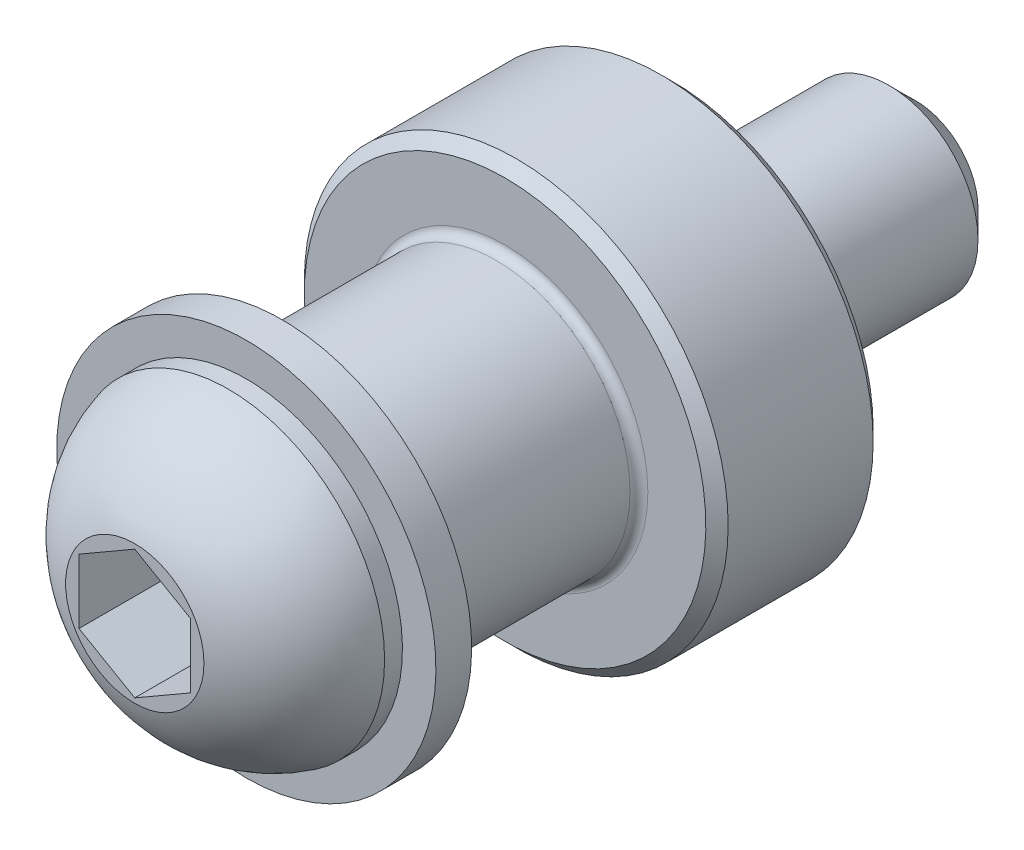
ISO-10303-21;
HEADER;
FILE_DESCRIPTION(('STEP AP214'),'2;1');
FILE_NAME('part.step','',(''),(''),'','','');
FILE_SCHEMA(('AUTOMOTIVE_DESIGN { 1 0 10303 214 1 1 1 1 }'));
ENDSEC;
DATA;
#1=APPLICATION_CONTEXT('core data for automotive mechanical design processes');
#2=APPLICATION_PROTOCOL_DEFINITION('international standard','automotive_design',2000,#1);
#3=PRODUCT_CONTEXT('',#1,'mechanical');
#4=PRODUCT('Part','Part','',(#3));
#5=PRODUCT_RELATED_PRODUCT_CATEGORY('part','',(#4));
#6=PRODUCT_DEFINITION_FORMATION('','',#4);
#7=PRODUCT_DEFINITION_CONTEXT('part definition',#1,'design');
#8=PRODUCT_DEFINITION('design','',#6,#7);
#9=PRODUCT_DEFINITION_SHAPE('','',#8);
#10=(LENGTH_UNIT() NAMED_UNIT(*) SI_UNIT(.MILLI.,.METRE.));
#11=(NAMED_UNIT(*) PLANE_ANGLE_UNIT() SI_UNIT($,.RADIAN.));
#12=(NAMED_UNIT(*) SI_UNIT($,.STERADIAN.) SOLID_ANGLE_UNIT());
#13=UNCERTAINTY_MEASURE_WITH_UNIT(LENGTH_MEASURE(1.E-05),#10,'distance_accuracy_value','');
#14=(GEOMETRIC_REPRESENTATION_CONTEXT(3) GLOBAL_UNCERTAINTY_ASSIGNED_CONTEXT((#13)) GLOBAL_UNIT_ASSIGNED_CONTEXT((#10,
#11,#12)) REPRESENTATION_CONTEXT('',''));
#15=CARTESIAN_POINT('',(0.,0.,0.));
#16=DIRECTION('',(0.,0.,1.));
#17=DIRECTION('',(1.,0.,0.));
#18=AXIS2_PLACEMENT_3D('',#15,#16,#17);
#19=CARTESIAN_POINT('',(2.5,-2.921392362,20.1));
#20=DIRECTION('',(0.,0.,-1.));
#21=DIRECTION('',(-1.,0.,0.));
#22=AXIS2_PLACEMENT_3D('',#19,#20,#21);
#23=PLANE('',#22);
#24=DIRECTION('',(-0.866025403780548,-0.500000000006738,0.));
#25=VECTOR('',#24,1.);
#26=CARTESIAN_POINT('',(-1.25,2.1650635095,20.1));
#27=LINE('',#26,#25);
#28=CARTESIAN_POINT('',(-7.05487453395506E-10,2.88675134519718,20.1));
#29=VERTEX_POINT('',#28);
#30=CARTESIAN_POINT('',(-2.5,1.44337567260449,20.1));
#31=VERTEX_POINT('',#30);
#32=EDGE_CURVE('E79',#29,#31,#27,.T.);
#33=ORIENTED_EDGE('',*,*,#32,.T.);
#34=DIRECTION('',(0.,-1.,0.));
#35=VECTOR('',#34,1.);
#36=CARTESIAN_POINT('',(-2.5,0.,20.1));
#37=LINE('',#36,#35);
#38=CARTESIAN_POINT('',(-2.5,-1.44337567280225,20.1));
#39=VERTEX_POINT('',#38);
#40=EDGE_CURVE('E74',#31,#39,#37,.T.);
#41=ORIENTED_EDGE('',*,*,#40,.T.);
#42=DIRECTION('',(0.866025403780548,-0.500000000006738,0.));
#43=VECTOR('',#42,1.);
#44=CARTESIAN_POINT('',(-1.25,-2.1650635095,20.1));
#45=LINE('',#44,#43);
#46=CARTESIAN_POINT('',(7.05487453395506E-10,-2.88675134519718,20.1));
#47=VERTEX_POINT('',#46);
#48=EDGE_CURVE('E76',#39,#47,#45,.T.);
#49=ORIENTED_EDGE('',*,*,#48,.T.);
#50=DIRECTION('',(0.866025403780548,0.500000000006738,0.));
#51=VECTOR('',#50,1.);
#52=CARTESIAN_POINT('',(1.25,-2.1650635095,20.1));
#53=LINE('',#52,#51);
#54=CARTESIAN_POINT('',(2.5,-1.44337567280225,20.1));
#55=VERTEX_POINT('',#54);
#56=EDGE_CURVE('E92',#47,#55,#53,.T.);
#57=ORIENTED_EDGE('',*,*,#56,.T.);
#58=DIRECTION('',(0.,1.,0.));
#59=VECTOR('',#58,1.);
#60=CARTESIAN_POINT('',(2.5,0.,20.1));
#61=LINE('',#60,#59);
#62=CARTESIAN_POINT('',(2.5,1.44337567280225,20.1));
#63=VERTEX_POINT('',#62);
#64=EDGE_CURVE('E97',#55,#63,#61,.T.);
#65=ORIENTED_EDGE('',*,*,#64,.T.);
#66=DIRECTION('',(-0.866025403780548,0.500000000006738,0.));
#67=VECTOR('',#66,1.);
#68=CARTESIAN_POINT('',(1.25,2.1650635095,20.1));
#69=LINE('',#68,#67);
#70=EDGE_CURVE('E100',#63,#29,#69,.T.);
#71=ORIENTED_EDGE('',*,*,#70,.T.);
#72=EDGE_LOOP('',(#33,#41,#49,#57,#65,#71));
#73=FACE_BOUND('',#72,.T.);
#74=ADVANCED_FACE('F14',(#73),#23,.F.);
#75=CARTESIAN_POINT('',(-2.5,1.443375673,24.1));
#76=DIRECTION('',(-0.500000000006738,0.866025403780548,0.));
#77=DIRECTION('',(0.866025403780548,0.500000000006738,0.));
#78=AXIS2_PLACEMENT_3D('',#75,#76,#77);
#79=PLANE('',#78);
#80=DIRECTION('',(0.,0.,1.));
#81=VECTOR('',#80,1.);
#82=CARTESIAN_POINT('',(-2.5,1.443375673,22.1));
#83=LINE('',#82,#81);
#84=CARTESIAN_POINT('',(-2.49999999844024,1.44337567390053,24.1));
#85=VERTEX_POINT('',#84);
#86=EDGE_CURVE('E54',#31,#85,#83,.T.);
#87=ORIENTED_EDGE('',*,*,#86,.F.);
#88=ORIENTED_EDGE('',*,*,#32,.F.);
#89=DIRECTION('',(0.,0.,-1.));
#90=VECTOR('',#89,1.);
#91=CARTESIAN_POINT('',(0.,2.886751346,22.1));
#92=LINE('',#91,#90);
#93=CARTESIAN_POINT('',(0.,2.886751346,24.1));
#94=VERTEX_POINT('',#93);
#95=EDGE_CURVE('E102',#94,#29,#92,.T.);
#96=ORIENTED_EDGE('',*,*,#95,.F.);
#97=DIRECTION('',(0.866025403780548,0.500000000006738,0.));
#98=VECTOR('',#97,1.);
#99=CARTESIAN_POINT('',(-2.5,1.443375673,24.1));
#100=LINE('',#99,#98);
#101=EDGE_CURVE('E139',#94,#85,#100,.F.);
#102=ORIENTED_EDGE('',*,*,#101,.T.);
#103=EDGE_LOOP('',(#87,#88,#96,#102));
#104=FACE_BOUND('',#103,.T.);
#105=ADVANCED_FACE('F247',(#104),#79,.F.);
#106=CARTESIAN_POINT('',(-2.5,-1.443375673,24.1));
#107=DIRECTION('',(-1.,0.,0.));
#108=DIRECTION('',(0.,1.,0.));
#109=AXIS2_PLACEMENT_3D('',#106,#107,#108);
#110=PLANE('',#109);
#111=DIRECTION('',(0.,0.,-1.));
#112=VECTOR('',#111,1.);
#113=CARTESIAN_POINT('',(-2.5,-1.443375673,22.1));
#114=LINE('',#113,#112);
#115=CARTESIAN_POINT('',(-2.49999999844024,-1.44337567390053,24.1));
#116=VERTEX_POINT('',#115);
#117=EDGE_CURVE('E80',#116,#39,#114,.T.);
#118=ORIENTED_EDGE('',*,*,#117,.T.);
#119=ORIENTED_EDGE('',*,*,#40,.F.);
#120=ORIENTED_EDGE('',*,*,#86,.T.);
#121=DIRECTION('',(0.,-1.,0.));
#122=VECTOR('',#121,1.);
#123=CARTESIAN_POINT('',(-2.49999999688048,0.,24.1));
#124=LINE('',#123,#122);
#125=EDGE_CURVE('E48',#85,#116,#124,.T.);
#126=ORIENTED_EDGE('',*,*,#125,.T.);
#127=EDGE_LOOP('',(#118,#119,#120,#126));
#128=FACE_BOUND('',#127,.T.);
#129=ADVANCED_FACE('F83',(#128),#110,.F.);
#130=CARTESIAN_POINT('',(0.,-2.886751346,24.1));
#131=DIRECTION('',(-0.500000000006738,-0.866025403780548,0.));
#132=DIRECTION('',(-0.866025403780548,0.500000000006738,0.));
#133=AXIS2_PLACEMENT_3D('',#130,#131,#132);
#134=PLANE('',#133);
#135=DIRECTION('',(0.,0.,-1.));
#136=VECTOR('',#135,1.);
#137=CARTESIAN_POINT('',(0.,-2.886751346,22.1));
#138=LINE('',#137,#136);
#139=CARTESIAN_POINT('',(0.,-2.886751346,24.1));
#140=VERTEX_POINT('',#139);
#141=EDGE_CURVE('E89',#140,#47,#138,.T.);
#142=ORIENTED_EDGE('',*,*,#141,.T.);
#143=ORIENTED_EDGE('',*,*,#48,.F.);
#144=ORIENTED_EDGE('',*,*,#117,.F.);
#145=DIRECTION('',(-0.866025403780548,0.500000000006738,0.));
#146=VECTOR('',#145,1.);
#147=CARTESIAN_POINT('',(0.,-2.886751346,24.1));
#148=LINE('',#147,#146);
#149=EDGE_CURVE('E121',#116,#140,#148,.F.);
#150=ORIENTED_EDGE('',*,*,#149,.T.);
#151=EDGE_LOOP('',(#142,#143,#144,#150));
#152=FACE_BOUND('',#151,.T.);
#153=ADVANCED_FACE('F87',(#152),#134,.F.);
#154=CARTESIAN_POINT('',(2.5,-1.443375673,24.1));
#155=DIRECTION('',(0.500000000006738,-0.866025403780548,0.));
#156=DIRECTION('',(-0.866025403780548,-0.500000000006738,0.));
#157=AXIS2_PLACEMENT_3D('',#154,#155,#156);
#158=PLANE('',#157);
#159=DIRECTION('',(0.,0.,-1.));
#160=VECTOR('',#159,1.);
#161=CARTESIAN_POINT('',(2.5,-1.443375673,22.1));
#162=LINE('',#161,#160);
#163=CARTESIAN_POINT('',(2.49999999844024,-1.44337567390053,24.1));
#164=VERTEX_POINT('',#163);
#165=EDGE_CURVE('E96',#164,#55,#162,.T.);
#166=ORIENTED_EDGE('',*,*,#165,.T.);
#167=ORIENTED_EDGE('',*,*,#56,.F.);
#168=ORIENTED_EDGE('',*,*,#141,.F.);
#169=DIRECTION('',(-0.866025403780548,-0.500000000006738,0.));
#170=VECTOR('',#169,1.);
#171=CARTESIAN_POINT('',(2.5,-1.443375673,24.1));
#172=LINE('',#171,#170);
#173=EDGE_CURVE('E115',#140,#164,#172,.F.);
#174=ORIENTED_EDGE('',*,*,#173,.T.);
#175=EDGE_LOOP('',(#166,#167,#168,#174));
#176=FACE_BOUND('',#175,.T.);
#177=ADVANCED_FACE('F256',(#176),#158,.F.);
#178=CARTESIAN_POINT('',(2.5,-1.443375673,24.1));
#179=DIRECTION('',(1.,0.,0.));
#180=DIRECTION('',(0.,0.,-1.));
#181=AXIS2_PLACEMENT_3D('',#178,#179,#180);
#182=PLANE('',#181);
#183=DIRECTION('',(0.,0.,-1.));
#184=VECTOR('',#183,1.);
#185=CARTESIAN_POINT('',(2.5,1.443375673,22.1));
#186=LINE('',#185,#184);
#187=CARTESIAN_POINT('',(2.49999999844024,1.44337567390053,24.1));
#188=VERTEX_POINT('',#187);
#189=EDGE_CURVE('E99',#188,#63,#186,.T.);
#190=ORIENTED_EDGE('',*,*,#189,.T.);
#191=ORIENTED_EDGE('',*,*,#64,.F.);
#192=ORIENTED_EDGE('',*,*,#165,.F.);
#193=DIRECTION('',(0.,1.,0.));
#194=VECTOR('',#193,1.);
#195=CARTESIAN_POINT('',(2.49999999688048,0.,24.1));
#196=LINE('',#195,#194);
#197=EDGE_CURVE('E113',#164,#188,#196,.T.);
#198=ORIENTED_EDGE('',*,*,#197,.T.);
#199=EDGE_LOOP('',(#190,#191,#192,#198));
#200=FACE_BOUND('',#199,.T.);
#201=ADVANCED_FACE('F253',(#200),#182,.F.);
#202=CARTESIAN_POINT('',(0.,2.886751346,24.1));
#203=DIRECTION('',(0.500000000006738,0.866025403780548,0.));
#204=DIRECTION('',(0.866025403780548,-0.500000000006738,0.));
#205=AXIS2_PLACEMENT_3D('',#202,#203,#204);
#206=PLANE('',#205);
#207=ORIENTED_EDGE('',*,*,#95,.T.);
#208=ORIENTED_EDGE('',*,*,#70,.F.);
#209=ORIENTED_EDGE('',*,*,#189,.F.);
#210=DIRECTION('',(0.866025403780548,-0.500000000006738,0.));
#211=VECTOR('',#210,1.);
#212=CARTESIAN_POINT('',(0.,2.886751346,24.1));
#213=LINE('',#212,#211);
#214=EDGE_CURVE('E33',#188,#94,#213,.F.);
#215=ORIENTED_EDGE('',*,*,#214,.T.);
#216=EDGE_LOOP('',(#207,#208,#209,#215));
#217=FACE_BOUND('',#216,.T.);
#218=ADVANCED_FACE('F245',(#217),#206,.F.);
#219=CARTESIAN_POINT('',(3.138458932,-3.149258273,24.1));
#220=DIRECTION('',(0.,0.,-1.));
#221=DIRECTION('',(-1.,0.,0.));
#222=AXIS2_PLACEMENT_3D('',#219,#220,#221);
#223=PLANE('',#222);
#224=ORIENTED_EDGE('',*,*,#214,.F.);
#225=ORIENTED_EDGE('',*,*,#197,.F.);
#226=ORIENTED_EDGE('',*,*,#173,.F.);
#227=ORIENTED_EDGE('',*,*,#149,.F.);
#228=ORIENTED_EDGE('',*,*,#125,.F.);
#229=ORIENTED_EDGE('',*,*,#101,.F.);
#230=EDGE_LOOP('',(#224,#225,#226,#227,#228,#229));
#231=FACE_BOUND('',#230,.T.);
#232=CARTESIAN_POINT('',(0.,0.,24.0999999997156));
#233=DIRECTION('',(0.,0.,1.));
#234=DIRECTION('',(1.,0.,0.));
#235=AXIS2_PLACEMENT_3D('',#232,#233,#234);
#236=CIRCLE('',#235,3.10124400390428);
#237=CARTESIAN_POINT('',(3.10124400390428,0.,24.0999999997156));
#238=VERTEX_POINT('',#237);
#239=EDGE_CURVE('E112',#238,#238,#236,.F.);
#240=ORIENTED_EDGE('',*,*,#239,.F.);
#241=EDGE_LOOP('',(#240));
#242=FACE_BOUND('',#241,.T.);
#243=ADVANCED_FACE('F241',(#231,#242),#223,.F.);
#244=CARTESIAN_POINT('',(0.,0.,18.4135382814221));
#245=DIRECTION('',(0.,0.,1.));
#246=DIRECTION('',(1.,0.,0.));
#247=AXIS2_PLACEMENT_3D('',#244,#245,#246);
#248=DEGENERATE_TOROIDAL_SURFACE('',#247,1.18704622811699,5.99999999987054,.T.);
#249=ORIENTED_EDGE('',*,*,#239,.T.);
#250=EDGE_LOOP('',(#249));
#251=FACE_BOUND('',#250,.T.);
#252=CARTESIAN_POINT('',(0.,0.,19.9));
#253=DIRECTION('',(0.,0.,1.));
#254=DIRECTION('',(1.,0.,0.));
#255=AXIS2_PLACEMENT_3D('',#252,#253,#254);
#256=CIRCLE('',#255,7.);
#257=CARTESIAN_POINT('',(7.,0.,19.9));
#258=VERTEX_POINT('',#257);
#259=EDGE_CURVE('E108',#258,#258,#256,.F.);
#260=ORIENTED_EDGE('',*,*,#259,.F.);
#261=EDGE_LOOP('',(#260));
#262=FACE_BOUND('',#261,.T.);
#263=ADVANCED_FACE('F238',(#251,#262),#248,.T.);
#264=CARTESIAN_POINT('',(0.,0.,19.1));
#265=DIRECTION('',(0.,0.,1.));
#266=DIRECTION('',(0.,-1.,0.));
#267=AXIS2_PLACEMENT_3D('',#264,#265,#266);
#268=CYLINDRICAL_SURFACE('',#267,7.);
#269=ORIENTED_EDGE('',*,*,#259,.T.);
#270=EDGE_LOOP('',(#269));
#271=FACE_BOUND('',#270,.T.);
#272=CARTESIAN_POINT('',(0.,0.,19.1));
#273=DIRECTION('',(0.,0.,1.));
#274=DIRECTION('',(0.,-1.,0.));
#275=AXIS2_PLACEMENT_3D('',#272,#273,#274);
#276=CIRCLE('',#275,7.);
#277=CARTESIAN_POINT('',(0.,-7.,19.1));
#278=VERTEX_POINT('',#277);
#279=EDGE_CURVE('E111',#278,#278,#276,.T.);
#280=ORIENTED_EDGE('',*,*,#279,.T.);
#281=EDGE_LOOP('',(#280));
#282=FACE_BOUND('',#281,.T.);
#283=ADVANCED_FACE('F236',(#271,#282),#268,.T.);
#284=CARTESIAN_POINT('',(8.602,-8.631599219,19.1));
#285=DIRECTION('',(0.,0.,-1.));
#286=DIRECTION('',(-1.,0.,0.));
#287=AXIS2_PLACEMENT_3D('',#284,#285,#286);
#288=PLANE('',#287);
#289=ORIENTED_EDGE('',*,*,#279,.F.);
#290=EDGE_LOOP('',(#289));
#291=FACE_BOUND('',#290,.T.);
#292=CARTESIAN_POINT('',(0.,0.,19.1));
#293=DIRECTION('',(0.,0.,1.));
#294=DIRECTION('',(0.,-1.,0.));
#295=AXIS2_PLACEMENT_3D('',#292,#293,#294);
#296=CIRCLE('',#295,8.5);
#297=CARTESIAN_POINT('',(0.,-8.5,19.1));
#298=VERTEX_POINT('',#297);
#299=EDGE_CURVE('E132',#298,#298,#296,.F.);
#300=ORIENTED_EDGE('',*,*,#299,.F.);
#301=EDGE_LOOP('',(#300));
#302=FACE_BOUND('',#301,.T.);
#303=ADVANCED_FACE('F233',(#291,#302),#288,.F.);
#304=CARTESIAN_POINT('',(0.,0.,17.5));
#305=DIRECTION('',(0.,0.,1.));
#306=DIRECTION('',(0.,-1.,0.));
#307=AXIS2_PLACEMENT_3D('',#304,#305,#306);
#308=CYLINDRICAL_SURFACE('',#307,8.5);
#309=ORIENTED_EDGE('',*,*,#299,.T.);
#310=EDGE_LOOP('',(#309));
#311=FACE_BOUND('',#310,.T.);
#312=CARTESIAN_POINT('',(0.,0.,17.5));
#313=DIRECTION('',(0.,0.,1.));
#314=DIRECTION('',(0.,-1.,0.));
#315=AXIS2_PLACEMENT_3D('',#312,#313,#314);
#316=CIRCLE('',#315,8.5);
#317=CARTESIAN_POINT('',(0.,-8.5,17.5));
#318=VERTEX_POINT('',#317);
#319=EDGE_CURVE('E129',#318,#318,#316,.T.);
#320=ORIENTED_EDGE('',*,*,#319,.T.);
#321=EDGE_LOOP('',(#320));
#322=FACE_BOUND('',#321,.T.);
#323=ADVANCED_FACE('F231',(#311,#322),#308,.T.);
#324=CARTESIAN_POINT('',(-8.602,-8.631599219,17.5));
#325=DIRECTION('',(0.,0.,1.));
#326=DIRECTION('',(1.,0.,0.));
#327=AXIS2_PLACEMENT_3D('',#324,#325,#326);
#328=PLANE('',#327);
#329=CARTESIAN_POINT('',(0.,0.,17.5));
#330=DIRECTION('',(0.,0.,1.));
#331=DIRECTION('',(1.,0.,0.));
#332=AXIS2_PLACEMENT_3D('',#329,#330,#331);
#333=CIRCLE('',#332,4.);
#334=CARTESIAN_POINT('',(4.,0.,17.5));
#335=VERTEX_POINT('',#334);
#336=EDGE_CURVE('E126',#335,#335,#333,.F.);
#337=ORIENTED_EDGE('',*,*,#336,.F.);
#338=EDGE_LOOP('',(#337));
#339=FACE_BOUND('',#338,.T.);
#340=ORIENTED_EDGE('',*,*,#319,.F.);
#341=EDGE_LOOP('',(#340));
#342=FACE_BOUND('',#341,.T.);
#343=ADVANCED_FACE('F227',(#339,#342),#328,.F.);
#344=CARTESIAN_POINT('',(0.,0.,-9.7));
#345=DIRECTION('',(0.,0.,1.));
#346=DIRECTION('',(1.,0.,0.));
#347=AXIS2_PLACEMENT_3D('',#344,#345,#346);
#348=CYLINDRICAL_SURFACE('',#347,4.);
#349=ORIENTED_EDGE('',*,*,#336,.T.);
#350=EDGE_LOOP('',(#349));
#351=FACE_BOUND('',#350,.T.);
#352=CARTESIAN_POINT('',(0.,0.,17.));
#353=DIRECTION('',(0.,0.,-1.));
#354=DIRECTION('',(0.,1.,0.));
#355=AXIS2_PLACEMENT_3D('',#352,#353,#354);
#356=CIRCLE('',#355,4.);
#357=CARTESIAN_POINT('',(0.,4.,17.));
#358=VERTEX_POINT('',#357);
#359=EDGE_CURVE('E24',#358,#358,#356,.T.);
#360=ORIENTED_EDGE('',*,*,#359,.F.);
#361=EDGE_LOOP('',(#360));
#362=FACE_BOUND('',#361,.T.);
#363=ADVANCED_FACE('F230',(#351,#362),#348,.T.);
#364=CARTESIAN_POINT('',(0.,0.,-9.7));
#365=DIRECTION('',(0.,0.,1.));
#366=DIRECTION('',(1.,0.,0.));
#367=AXIS2_PLACEMENT_3D('',#364,#365,#366);
#368=CIRCLE('',#367,4.);
#369=CARTESIAN_POINT('',(4.,0.,-9.69999999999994));
#370=VERTEX_POINT('',#369);
#371=EDGE_CURVE('E104',#370,#370,#368,.F.);
#372=ORIENTED_EDGE('',*,*,#371,.F.);
#373=EDGE_LOOP('',(#372));
#374=FACE_BOUND('',#373,.T.);
#375=CARTESIAN_POINT('',(0.,0.,0.));
#376=DIRECTION('',(0.,0.,1.));
#377=DIRECTION('',(0.,-1.,0.));
#378=AXIS2_PLACEMENT_3D('',#375,#376,#377);
#379=CIRCLE('',#378,4.);
#380=CARTESIAN_POINT('',(0.,-4.,0.));
#381=VERTEX_POINT('',#380);
#382=EDGE_CURVE('E9',#381,#381,#379,.T.);
#383=ORIENTED_EDGE('',*,*,#382,.F.);
#384=EDGE_LOOP('',(#383));
#385=FACE_BOUND('',#384,.T.);
#386=ADVANCED_FACE('F187',(#374,#385),#348,.T.);
#387=CARTESIAN_POINT('',(-2.8336,-2.843350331,-10.9));
#388=DIRECTION('',(0.,0.,1.));
#389=DIRECTION('',(1.,0.,0.));
#390=AXIS2_PLACEMENT_3D('',#387,#388,#389);
#391=PLANE('',#390);
#392=CARTESIAN_POINT('',(0.,0.,-10.9));
#393=DIRECTION('',(0.,0.,1.));
#394=DIRECTION('',(1.,0.,0.));
#395=AXIS2_PLACEMENT_3D('',#392,#393,#394);
#396=CIRCLE('',#395,2.8);
#397=CARTESIAN_POINT('',(2.8,0.,-10.9));
#398=VERTEX_POINT('',#397);
#399=EDGE_CURVE('E107',#398,#398,#396,.T.);
#400=ORIENTED_EDGE('',*,*,#399,.F.);
#401=EDGE_LOOP('',(#400));
#402=FACE_BOUND('',#401,.T.);
#403=ADVANCED_FACE('F184',(#402),#391,.F.);
#404=CARTESIAN_POINT('',(0.,0.,-10.9));
#405=DIRECTION('',(0.,0.,1.));
#406=DIRECTION('',(1.,0.,0.));
#407=AXIS2_PLACEMENT_3D('',#404,#405,#406);
#408=CONICAL_SURFACE('',#407,2.8,0.785398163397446);
#409=ORIENTED_EDGE('',*,*,#371,.T.);
#410=EDGE_LOOP('',(#409));
#411=FACE_BOUND('',#410,.T.);
#412=ORIENTED_EDGE('',*,*,#399,.T.);
#413=EDGE_LOOP('',(#412));
#414=FACE_BOUND('',#413,.T.);
#415=ADVANCED_FACE('F171',(#411,#414),#408,.T.);
#416=CARTESIAN_POINT('',(9.108,-9.139340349,7.5));
#417=DIRECTION('',(0.,0.,-1.));
#418=DIRECTION('',(-1.,0.,0.));
#419=AXIS2_PLACEMENT_3D('',#416,#417,#418);
#420=PLANE('',#419);
#421=CARTESIAN_POINT('',(0.,0.,7.5));
#422=DIRECTION('',(0.,0.,1.));
#423=DIRECTION('',(0.,-1.,0.));
#424=AXIS2_PLACEMENT_3D('',#421,#422,#423);
#425=CIRCLE('',#424,6.4);
#426=CARTESIAN_POINT('',(0.,-6.4,7.5));
#427=VERTEX_POINT('',#426);
#428=EDGE_CURVE('E161',#427,#427,#425,.F.);
#429=ORIENTED_EDGE('',*,*,#428,.T.);
#430=EDGE_LOOP('',(#429));
#431=FACE_BOUND('',#430,.T.);
#432=CARTESIAN_POINT('',(0.,0.,7.5));
#433=DIRECTION('',(0.,0.,-1.));
#434=DIRECTION('',(0.,1.,0.));
#435=AXIS2_PLACEMENT_3D('',#432,#433,#434);
#436=CIRCLE('',#435,9.);
#437=CARTESIAN_POINT('',(0.,9.,7.5));
#438=VERTEX_POINT('',#437);
#439=EDGE_CURVE('E155',#438,#438,#436,.T.);
#440=ORIENTED_EDGE('',*,*,#439,.F.);
#441=EDGE_LOOP('',(#440));
#442=FACE_BOUND('',#441,.T.);
#443=ADVANCED_FACE('F169',(#431,#442),#420,.F.);
#444=CARTESIAN_POINT('',(0.,0.,7.9));
#445=DIRECTION('',(0.,0.,1.));
#446=DIRECTION('',(0.,-1.,0.));
#447=AXIS2_PLACEMENT_3D('',#444,#445,#446);
#448=TOROIDAL_SURFACE('',#447,6.4,0.4);
#449=CARTESIAN_POINT('',(0.,0.,7.9));
#450=DIRECTION('',(0.,0.,1.));
#451=DIRECTION('',(1.,0.,0.));
#452=AXIS2_PLACEMENT_3D('',#449,#450,#451);
#453=CIRCLE('',#452,6.);
#454=CARTESIAN_POINT('',(6.,0.,7.9));
#455=VERTEX_POINT('',#454);
#456=EDGE_CURVE('E148',#455,#455,#453,.T.);
#457=ORIENTED_EDGE('',*,*,#456,.F.);
#458=EDGE_LOOP('',(#457));
#459=FACE_BOUND('',#458,.T.);
#460=ORIENTED_EDGE('',*,*,#428,.F.);
#461=EDGE_LOOP('',(#460));
#462=FACE_BOUND('',#461,.T.);
#463=ADVANCED_FACE('F16',(#459,#462),#448,.F.);
#464=CARTESIAN_POINT('',(0.,0.,7.9));
#465=DIRECTION('',(0.,0.,1.));
#466=DIRECTION('',(1.,0.,0.));
#467=AXIS2_PLACEMENT_3D('',#464,#465,#466);
#468=CYLINDRICAL_SURFACE('',#467,6.);
#469=CARTESIAN_POINT('',(0.,0.,16.5));
#470=DIRECTION('',(0.,0.,1.));
#471=DIRECTION('',(1.,0.,0.));
#472=AXIS2_PLACEMENT_3D('',#469,#470,#471);
#473=CIRCLE('',#472,6.);
#474=CARTESIAN_POINT('',(6.,0.,16.5));
#475=VERTEX_POINT('',#474);
#476=EDGE_CURVE('E81',#475,#475,#473,.F.);
#477=ORIENTED_EDGE('',*,*,#476,.T.);
#478=EDGE_LOOP('',(#477));
#479=FACE_BOUND('',#478,.T.);
#480=ORIENTED_EDGE('',*,*,#456,.T.);
#481=EDGE_LOOP('',(#480));
#482=FACE_BOUND('',#481,.T.);
#483=ADVANCED_FACE('F181',(#479,#482),#468,.T.);
#484=CARTESIAN_POINT('',(0.,0.,17.));
#485=DIRECTION('',(0.,0.,-1.));
#486=DIRECTION('',(-1.,0.,0.));
#487=AXIS2_PLACEMENT_3D('',#484,#485,#486);
#488=CONICAL_SURFACE('',#487,5.5,0.785398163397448);
#489=ORIENTED_EDGE('',*,*,#476,.F.);
#490=EDGE_LOOP('',(#489));
#491=FACE_BOUND('',#490,.T.);
#492=CARTESIAN_POINT('',(0.,0.,17.));
#493=DIRECTION('',(0.,0.,-1.));
#494=DIRECTION('',(-1.,0.,0.));
#495=AXIS2_PLACEMENT_3D('',#492,#493,#494);
#496=CIRCLE('',#495,5.5);
#497=CARTESIAN_POINT('',(-5.5,0.,17.));
#498=VERTEX_POINT('',#497);
#499=EDGE_CURVE('E151',#498,#498,#496,.T.);
#500=ORIENTED_EDGE('',*,*,#499,.T.);
#501=EDGE_LOOP('',(#500));
#502=FACE_BOUND('',#501,.T.);
#503=ADVANCED_FACE('F183',(#491,#502),#488,.T.);
#504=CARTESIAN_POINT('',(5.566,-5.585152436,17.));
#505=DIRECTION('',(0.,0.,-1.));
#506=DIRECTION('',(-1.,0.,0.));
#507=AXIS2_PLACEMENT_3D('',#504,#505,#506);
#508=PLANE('',#507);
#509=ORIENTED_EDGE('',*,*,#499,.F.);
#510=EDGE_LOOP('',(#509));
#511=FACE_BOUND('',#510,.T.);
#512=ORIENTED_EDGE('',*,*,#359,.T.);
#513=EDGE_LOOP('',(#512));
#514=FACE_BOUND('',#513,.T.);
#515=ADVANCED_FACE('F174',(#511,#514),#508,.F.);
#516=CARTESIAN_POINT('',(0.,0.,7.5));
#517=DIRECTION('',(0.,0.,-1.));
#518=DIRECTION('',(0.,1.,0.));
#519=AXIS2_PLACEMENT_3D('',#516,#517,#518);
#520=CONICAL_SURFACE('',#519,9.,0.785398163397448);
#521=ORIENTED_EDGE('',*,*,#439,.T.);
#522=EDGE_LOOP('',(#521));
#523=FACE_BOUND('',#522,.T.);
#524=CARTESIAN_POINT('',(0.,0.,6.9999999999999));
#525=DIRECTION('',(0.,0.,-1.));
#526=DIRECTION('',(-1.,0.,0.));
#527=AXIS2_PLACEMENT_3D('',#524,#525,#526);
#528=CIRCLE('',#527,9.5);
#529=CARTESIAN_POINT('',(-9.5,0.,7.00000000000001));
#530=VERTEX_POINT('',#529);
#531=EDGE_CURVE('E152',#530,#530,#528,.F.);
#532=ORIENTED_EDGE('',*,*,#531,.T.);
#533=EDGE_LOOP('',(#532));
#534=FACE_BOUND('',#533,.T.);
#535=ADVANCED_FACE('F166',(#523,#534),#520,.T.);
#536=CARTESIAN_POINT('',(0.,0.,0.5));
#537=DIRECTION('',(0.,0.,1.));
#538=DIRECTION('',(1.,0.,0.));
#539=AXIS2_PLACEMENT_3D('',#536,#537,#538);
#540=CYLINDRICAL_SURFACE('',#539,9.5);
#541=CARTESIAN_POINT('',(0.,0.,0.5));
#542=DIRECTION('',(0.,0.,1.));
#543=DIRECTION('',(1.,0.,0.));
#544=AXIS2_PLACEMENT_3D('',#541,#542,#543);
#545=CIRCLE('',#544,9.5);
#546=CARTESIAN_POINT('',(9.5,0.,0.5));
#547=VERTEX_POINT('',#546);
#548=EDGE_CURVE('E156',#547,#547,#545,.T.);
#549=ORIENTED_EDGE('',*,*,#548,.T.);
#550=EDGE_LOOP('',(#549));
#551=FACE_BOUND('',#550,.T.);
#552=ORIENTED_EDGE('',*,*,#531,.F.);
#553=EDGE_LOOP('',(#552));
#554=FACE_BOUND('',#553,.T.);
#555=ADVANCED_FACE('F190',(#551,#554),#540,.T.);
#556=CARTESIAN_POINT('',(0.,0.,0.));
#557=DIRECTION('',(0.,0.,1.));
#558=DIRECTION('',(1.,0.,0.));
#559=AXIS2_PLACEMENT_3D('',#556,#557,#558);
#560=CONICAL_SURFACE('',#559,9.,0.785398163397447);
#561=ORIENTED_EDGE('',*,*,#548,.F.);
#562=EDGE_LOOP('',(#561));
#563=FACE_BOUND('',#562,.T.);
#564=CARTESIAN_POINT('',(0.,0.,0.));
#565=DIRECTION('',(0.,0.,1.));
#566=DIRECTION('',(1.,0.,0.));
#567=AXIS2_PLACEMENT_3D('',#564,#565,#566);
#568=CIRCLE('',#567,9.);
#569=CARTESIAN_POINT('',(9.,0.,0.));
#570=VERTEX_POINT('',#569);
#571=EDGE_CURVE('E18',#570,#570,#568,.T.);
#572=ORIENTED_EDGE('',*,*,#571,.T.);
#573=EDGE_LOOP('',(#572));
#574=FACE_BOUND('',#573,.T.);
#575=ADVANCED_FACE('F206',(#563,#574),#560,.T.);
#576=CARTESIAN_POINT('',(-9.108,-9.139340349,0.));
#577=DIRECTION('',(0.,0.,1.));
#578=DIRECTION('',(1.,0.,0.));
#579=AXIS2_PLACEMENT_3D('',#576,#577,#578);
#580=PLANE('',#579);
#581=ORIENTED_EDGE('',*,*,#571,.F.);
#582=EDGE_LOOP('',(#581));
#583=FACE_BOUND('',#582,.T.);
#584=ORIENTED_EDGE('',*,*,#382,.T.);
#585=EDGE_LOOP('',(#584));
#586=FACE_BOUND('',#585,.T.);
#587=ADVANCED_FACE('F192',(#583,#586),#580,.F.);
#588=CLOSED_SHELL('',(#74,#105,#129,#153,#177,#201,#218,#243,#263,#283,#303,#323,#343,#363,#386,
#403,#415,#443,#463,#483,#503,#515,#535,#555,#575,#587));
#589=MANIFOLD_SOLID_BREP('B1',#588);
#590=ADVANCED_BREP_SHAPE_REPRESENTATION('',(#18,#589),#14);
#591=SHAPE_DEFINITION_REPRESENTATION(#9,#590);
ENDSEC;
END-ISO-10303-21;
